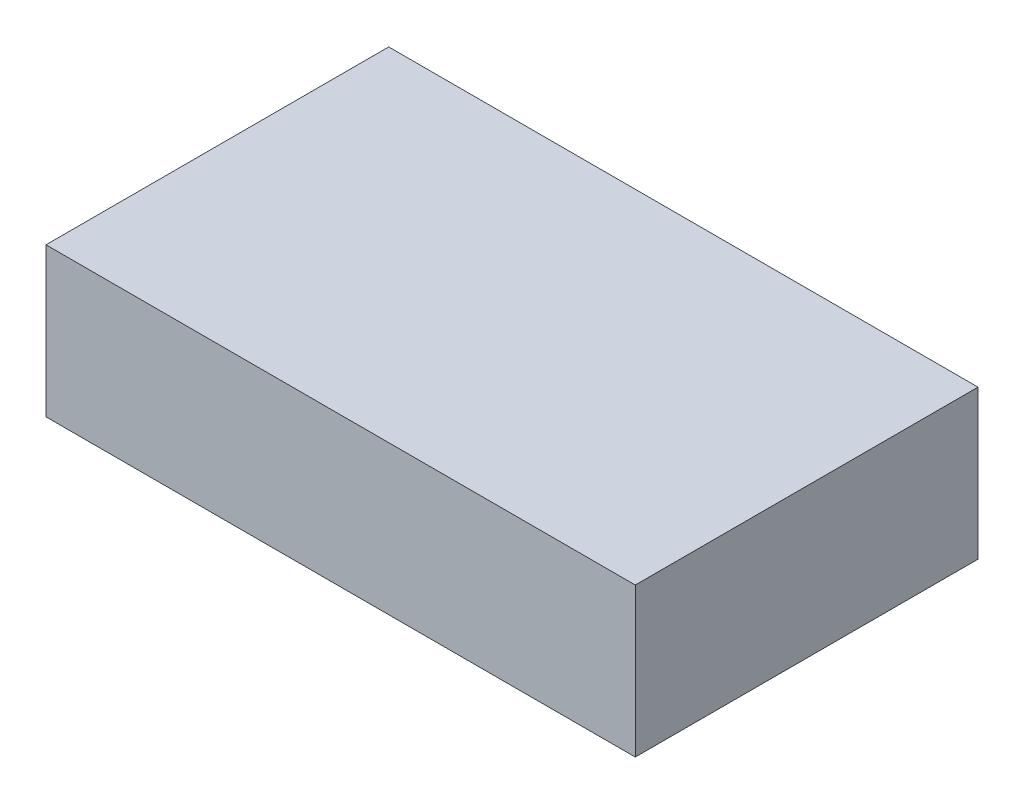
from build123d import *

# Parameters (mm, degrees)
ESQUISSE1_W      = 87
ESQUISSE1_H      = 22
EXTRUSION1_DEPTH = 50.6


with BuildPart() as part:
    # Esquisse1 → Extrusion1 (new body)
    with BuildSketch(Plane.XY):
        with Locations((43.5, 11)):
            Rectangle(ESQUISSE1_W, ESQUISSE1_H)
    extrude(amount=EXTRUSION1_DEPTH)


solid = part.part
